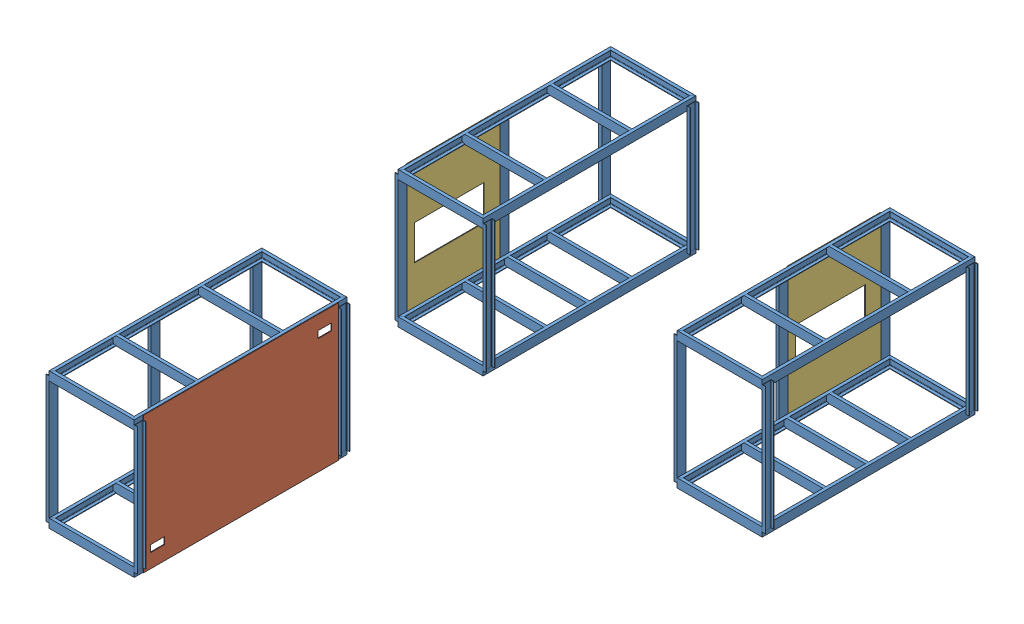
SolidWorks assembly HVAC and Ducting.SLDASM, configuration Default (file format 13000). Lengths in mm.
Overall size (5308.1 1955.8 8048).
6 component instances, 3 part files, 9 mates.
Components (placement in the parent):
- Frame-1: Frame.SLDPRT [Default] at origin size (1308.1 1955.8 3048)
- Frame-4: Frame.SLDPRT [Default] at (0 0 -5000) size (1308.1 1955.8 3048)
- Frame-5: Frame.SLDPRT [Default] at (4000 0 -5000) size (1308.1 1955.8 3048)
- Rear Wall-1: Rear Wall.sldprt [Default] at (1219.2 -63.5 -127) x (0 0 -1) z (1 0 0) size (2794 1955.8 10)
- Partial Wall-1: Partial Wall.sldprt [Default] at (0 -63.5 -6460.5) x (0 0 1) z (-1 0 0) size (1333.5 1955.8 10)
- Partial Wall-2: Partial Wall.sldprt [Default] at (4000 -63.5 -7921) x (0 0 1) z (-1 0 0) size (1333.5 1955.8 10)
Mates (geometry in assembly coordinates):
- Coincident7: coincident anti-aligned: plane of Frame-5 through (4000 1765.3 -5000) normal (-1 0 0); plane of Partial Wall-2 through (4000 -63.5 -7921) normal (1 0 0)
- Coincident8: coincident aligned: plane of Partial Wall-2 through (3990 -63.5 -7921) normal (0 -1 0); plane of Frame-5 through (4000 -63.5 -8066.288) normal (0 -1 0)
- Coincident9: coincident: plane of Frame-5 through (4000 0 -6587.5) normal (0 0 -1); line of Partial Wall-2 through (3990 -63.5 -6587.5) axis (0 1 0)
- Coincident10: coincident anti-aligned: plane of Frame-1 through (1219.2 0 -127) normal (0 0 -1); plane of Rear Wall-1 through (1229.2 -63.5 -127) normal (0 0 1)
- Coincident11: coincident aligned: plane of Frame-1 through (1174.75 -63.5 -3066.288) normal (0 -1 0); plane of Rear Wall-1 through (1229.2 -63.5 -127) normal (0 -1 0)
- Coincident12: coincident anti-aligned: plane of Frame-1 through (1219.2 -63.5 -3048) normal (1 0 0); plane of Rear Wall-1 through (1219.2 -63.5 -127) normal (-1 0 0)
- Coincident13: coincident anti-aligned: plane of Frame-4 through (0 1765.3 -5000) normal (-1 0 0); plane of Partial Wall-1 through (0 -63.5 -6460.5) normal (1 0 0)
- Coincident14: coincident aligned: plane of Frame-4 through (0 1892.3 -4981.712) normal (0 1 0); plane of Partial Wall-1 through (-10 1892.3 -6460.5) normal (0 1 0)
- Coincident15: coincident anti-aligned: plane of Frame-4 through (-44.45 0 -6460.5) normal (0 0 1); plane of Partial Wall-1 through (-10 1892.3 -6460.5) normal (0 0 -1)
